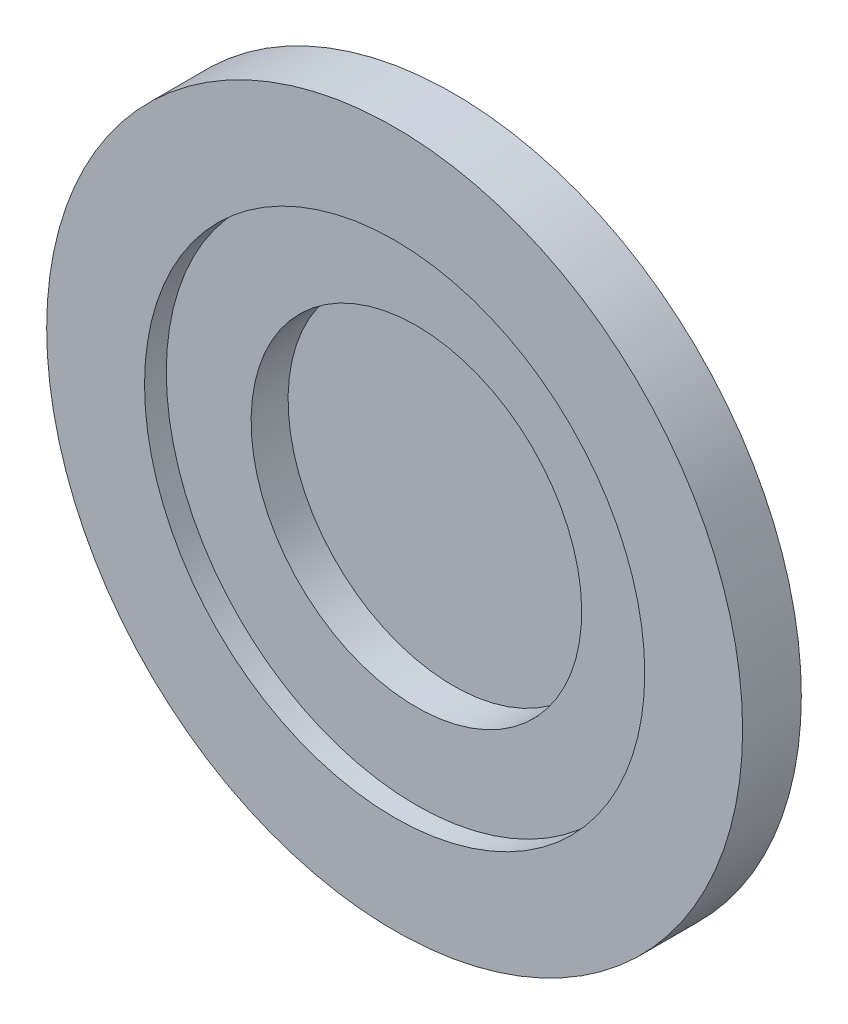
ISO-10303-21;
HEADER;
FILE_DESCRIPTION(('STEP AP214'),'2;1');
FILE_NAME('part.step','',(''),(''),'','','');
FILE_SCHEMA(('AUTOMOTIVE_DESIGN { 1 0 10303 214 1 1 1 1 }'));
ENDSEC;
DATA;
#1=APPLICATION_CONTEXT('core data for automotive mechanical design processes');
#2=APPLICATION_PROTOCOL_DEFINITION('international standard','automotive_design',2000,#1);
#3=PRODUCT_CONTEXT('',#1,'mechanical');
#4=PRODUCT('Part','Part','',(#3));
#5=PRODUCT_RELATED_PRODUCT_CATEGORY('part','',(#4));
#6=PRODUCT_DEFINITION_FORMATION('','',#4);
#7=PRODUCT_DEFINITION_CONTEXT('part definition',#1,'design');
#8=PRODUCT_DEFINITION('design','',#6,#7);
#9=PRODUCT_DEFINITION_SHAPE('','',#8);
#10=(LENGTH_UNIT() NAMED_UNIT(*) SI_UNIT(.MILLI.,.METRE.));
#11=(NAMED_UNIT(*) PLANE_ANGLE_UNIT() SI_UNIT($,.RADIAN.));
#12=(NAMED_UNIT(*) SI_UNIT($,.STERADIAN.) SOLID_ANGLE_UNIT());
#13=UNCERTAINTY_MEASURE_WITH_UNIT(LENGTH_MEASURE(1.E-05),#10,'distance_accuracy_value','');
#14=(GEOMETRIC_REPRESENTATION_CONTEXT(3) GLOBAL_UNCERTAINTY_ASSIGNED_CONTEXT((#13)) GLOBAL_UNIT_ASSIGNED_CONTEXT((#10,
#11,#12)) REPRESENTATION_CONTEXT('',''));
#15=CARTESIAN_POINT('',(0.,0.,0.));
#16=DIRECTION('',(0.,0.,1.));
#17=DIRECTION('',(1.,0.,0.));
#18=AXIS2_PLACEMENT_3D('',#15,#16,#17);
#19=CARTESIAN_POINT('',(-120.749995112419,-120.749995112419,17.));
#20=DIRECTION('',(0.,0.,1.));
#21=DIRECTION('',(1.,0.,0.));
#22=AXIS2_PLACEMENT_3D('',#19,#20,#21);
#23=PLANE('',#22);
#24=CARTESIAN_POINT('',(0.,0.,17.));
#25=DIRECTION('',(0.,0.,1.));
#26=DIRECTION('',(1.,0.,0.));
#27=AXIS2_PLACEMENT_3D('',#24,#25,#26);
#28=CIRCLE('',#27,76.);
#29=CARTESIAN_POINT('',(0.,76.0000000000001,17.));
#30=VERTEX_POINT('',#29);
#31=EDGE_CURVE('E31',#30,#30,#28,.T.);
#32=ORIENTED_EDGE('',*,*,#31,.F.);
#33=EDGE_LOOP('',(#32));
#34=FACE_BOUND('',#33,.T.);
#35=CARTESIAN_POINT('',(0.,1.2490009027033E-13,17.));
#36=DIRECTION('',(0.,0.,1.));
#37=DIRECTION('',(1.,0.,0.));
#38=AXIS2_PLACEMENT_3D('',#35,#36,#37);
#39=CIRCLE('',#38,115.);
#40=CARTESIAN_POINT('',(0.,115.,17.));
#41=VERTEX_POINT('',#40);
#42=EDGE_CURVE('E9',#41,#41,#39,.T.);
#43=ORIENTED_EDGE('',*,*,#42,.T.);
#44=EDGE_LOOP('',(#43));
#45=FACE_BOUND('',#44,.T.);
#46=ADVANCED_FACE('F14',(#34,#45),#23,.T.);
#47=CARTESIAN_POINT('',(0.,1.59594559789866E-13,27.));
#48=DIRECTION('',(0.,0.,-1.));
#49=DIRECTION('',(-1.,0.,0.));
#50=AXIS2_PLACEMENT_3D('',#47,#48,#49);
#51=CYLINDRICAL_SURFACE('',#50,115.);
#52=CARTESIAN_POINT('',(0.,1.59594559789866E-13,27.));
#53=DIRECTION('',(0.,0.,-1.));
#54=DIRECTION('',(-1.,0.,0.));
#55=AXIS2_PLACEMENT_3D('',#52,#53,#54);
#56=CIRCLE('',#55,115.);
#57=CARTESIAN_POINT('',(0.,115.,27.));
#58=VERTEX_POINT('',#57);
#59=EDGE_CURVE('E62',#58,#58,#56,.T.);
#60=ORIENTED_EDGE('',*,*,#59,.F.);
#61=DIRECTION('',(0.,0.,-1.));
#62=VECTOR('',#61,1.);
#63=CARTESIAN_POINT('',(0.,115.,22.));
#64=LINE('',#63,#62);
#65=EDGE_CURVE('E24',#58,#41,#64,.T.);
#66=ORIENTED_EDGE('',*,*,#65,.T.);
#67=ORIENTED_EDGE('',*,*,#42,.F.);
#68=ORIENTED_EDGE('',*,*,#65,.F.);
#69=EDGE_LOOP('',(#60,#66,#67,#68));
#70=FACE_BOUND('',#69,.T.);
#71=ADVANCED_FACE('F92',(#70),#51,.F.);
#72=CARTESIAN_POINT('',(167.999982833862,-167.999982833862,27.));
#73=DIRECTION('',(0.,0.,1.));
#74=DIRECTION('',(0.,1.,0.));
#75=AXIS2_PLACEMENT_3D('',#72,#73,#74);
#76=PLANE('',#75);
#77=ORIENTED_EDGE('',*,*,#59,.T.);
#78=EDGE_LOOP('',(#77));
#79=FACE_BOUND('',#78,.T.);
#80=CARTESIAN_POINT('',(0.,0.,27.));
#81=DIRECTION('',(0.,0.,-1.));
#82=DIRECTION('',(0.,1.,0.));
#83=AXIS2_PLACEMENT_3D('',#80,#81,#82);
#84=CIRCLE('',#83,160.);
#85=CARTESIAN_POINT('',(160.,0.,27.));
#86=VERTEX_POINT('',#85);
#87=EDGE_CURVE('E54',#86,#86,#84,.T.);
#88=ORIENTED_EDGE('',*,*,#87,.F.);
#89=EDGE_LOOP('',(#88));
#90=FACE_BOUND('',#89,.T.);
#91=ADVANCED_FACE('F60',(#79,#90),#76,.T.);
#92=CARTESIAN_POINT('',(0.,0.,0.));
#93=DIRECTION('',(0.,0.,1.));
#94=DIRECTION('',(1.,0.,0.));
#95=AXIS2_PLACEMENT_3D('',#92,#93,#94);
#96=CYLINDRICAL_SURFACE('',#95,160.);
#97=CARTESIAN_POINT('',(0.,0.,0.));
#98=DIRECTION('',(0.,0.,1.));
#99=DIRECTION('',(1.,0.,0.));
#100=AXIS2_PLACEMENT_3D('',#97,#98,#99);
#101=CIRCLE('',#100,160.);
#102=CARTESIAN_POINT('',(160.,0.,0.));
#103=VERTEX_POINT('',#102);
#104=EDGE_CURVE('E56',#103,#103,#101,.T.);
#105=ORIENTED_EDGE('',*,*,#104,.T.);
#106=DIRECTION('',(0.,0.,-1.));
#107=VECTOR('',#106,1.);
#108=CARTESIAN_POINT('',(160.,0.,13.5));
#109=LINE('',#108,#107);
#110=EDGE_CURVE('E51',#86,#103,#109,.T.);
#111=ORIENTED_EDGE('',*,*,#110,.F.);
#112=ORIENTED_EDGE('',*,*,#87,.T.);
#113=ORIENTED_EDGE('',*,*,#110,.T.);
#114=EDGE_LOOP('',(#105,#111,#112,#113));
#115=FACE_BOUND('',#114,.T.);
#116=ADVANCED_FACE('F53',(#115),#96,.T.);
#117=CARTESIAN_POINT('',(-167.999982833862,167.999982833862,0.));
#118=DIRECTION('',(0.,0.,-1.));
#119=DIRECTION('',(1.,0.,0.));
#120=AXIS2_PLACEMENT_3D('',#117,#118,#119);
#121=PLANE('',#120);
#122=CARTESIAN_POINT('',(0.,0.,0.));
#123=DIRECTION('',(0.,0.,1.));
#124=DIRECTION('',(1.,0.,0.));
#125=AXIS2_PLACEMENT_3D('',#122,#123,#124);
#126=CIRCLE('',#125,115.);
#127=CARTESIAN_POINT('',(115.,0.,0.));
#128=VERTEX_POINT('',#127);
#129=EDGE_CURVE('E57',#128,#128,#126,.T.);
#130=ORIENTED_EDGE('',*,*,#129,.T.);
#131=EDGE_LOOP('',(#130));
#132=FACE_BOUND('',#131,.T.);
#133=ORIENTED_EDGE('',*,*,#104,.F.);
#134=EDGE_LOOP('',(#133));
#135=FACE_BOUND('',#134,.T.);
#136=ADVANCED_FACE('F106',(#132,#135),#121,.T.);
#137=CARTESIAN_POINT('',(0.,0.,0.));
#138=DIRECTION('',(0.,0.,-1.));
#139=DIRECTION('',(-1.,0.,0.));
#140=AXIS2_PLACEMENT_3D('',#137,#138,#139);
#141=CYLINDRICAL_SURFACE('',#140,115.);
#142=ORIENTED_EDGE('',*,*,#129,.F.);
#143=DIRECTION('',(0.,0.,1.));
#144=VECTOR('',#143,1.);
#145=CARTESIAN_POINT('',(115.,0.,-5.));
#146=LINE('',#145,#144);
#147=CARTESIAN_POINT('',(115.,0.,-10.));
#148=VERTEX_POINT('',#147);
#149=EDGE_CURVE('E71',#148,#128,#146,.T.);
#150=ORIENTED_EDGE('',*,*,#149,.F.);
#151=CARTESIAN_POINT('',(0.,0.,-10.));
#152=DIRECTION('',(0.,0.,1.));
#153=DIRECTION('',(1.,0.,0.));
#154=AXIS2_PLACEMENT_3D('',#151,#152,#153);
#155=CIRCLE('',#154,115.);
#156=EDGE_CURVE('E68',#148,#148,#155,.T.);
#157=ORIENTED_EDGE('',*,*,#156,.T.);
#158=ORIENTED_EDGE('',*,*,#149,.T.);
#159=EDGE_LOOP('',(#142,#150,#157,#158));
#160=FACE_BOUND('',#159,.T.);
#161=ADVANCED_FACE('F88',(#160),#141,.T.);
#162=CARTESIAN_POINT('',(120.749995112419,120.749995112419,-10.));
#163=DIRECTION('',(0.,0.,-1.));
#164=DIRECTION('',(0.,-1.,0.));
#165=AXIS2_PLACEMENT_3D('',#162,#163,#164);
#166=PLANE('',#165);
#167=ORIENTED_EDGE('',*,*,#156,.F.);
#168=EDGE_LOOP('',(#167));
#169=FACE_BOUND('',#168,.T.);
#170=ADVANCED_FACE('F82',(#169),#166,.T.);
#171=CARTESIAN_POINT('',(0.,0.,17.));
#172=DIRECTION('',(0.,0.,-1.));
#173=DIRECTION('',(-1.,0.,0.));
#174=AXIS2_PLACEMENT_3D('',#171,#172,#173);
#175=CYLINDRICAL_SURFACE('',#174,76.);
#176=ORIENTED_EDGE('',*,*,#31,.T.);
#177=DIRECTION('',(0.,0.,1.));
#178=VECTOR('',#177,1.);
#179=CARTESIAN_POINT('',(0.,76.0000000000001,8.5));
#180=LINE('',#179,#178);
#181=CARTESIAN_POINT('',(0.,76.0000000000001,0.));
#182=VERTEX_POINT('',#181);
#183=EDGE_CURVE('E74',#182,#30,#180,.T.);
#184=ORIENTED_EDGE('',*,*,#183,.F.);
#185=CARTESIAN_POINT('',(0.,0.,0.));
#186=DIRECTION('',(0.,0.,1.));
#187=DIRECTION('',(1.,0.,0.));
#188=AXIS2_PLACEMENT_3D('',#185,#186,#187);
#189=CIRCLE('',#188,76.);
#190=EDGE_CURVE('E18',#182,#182,#189,.T.);
#191=ORIENTED_EDGE('',*,*,#190,.F.);
#192=ORIENTED_EDGE('',*,*,#183,.T.);
#193=EDGE_LOOP('',(#176,#184,#191,#192));
#194=FACE_BOUND('',#193,.T.);
#195=ADVANCED_FACE('F80',(#194),#175,.F.);
#196=CARTESIAN_POINT('',(-79.7999948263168,79.7999948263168,0.));
#197=DIRECTION('',(0.,0.,1.));
#198=DIRECTION('',(0.,-1.,0.));
#199=AXIS2_PLACEMENT_3D('',#196,#197,#198);
#200=PLANE('',#199);
#201=ORIENTED_EDGE('',*,*,#190,.T.);
#202=EDGE_LOOP('',(#201));
#203=FACE_BOUND('',#202,.T.);
#204=ADVANCED_FACE('F16',(#203),#200,.T.);
#205=CLOSED_SHELL('',(#46,#71,#91,#116,#136,#161,#170,#195,#204));
#206=MANIFOLD_SOLID_BREP('B1',#205);
#207=ADVANCED_BREP_SHAPE_REPRESENTATION('',(#18,#206),#14);
#208=SHAPE_DEFINITION_REPRESENTATION(#9,#207);
ENDSEC;
END-ISO-10303-21;
